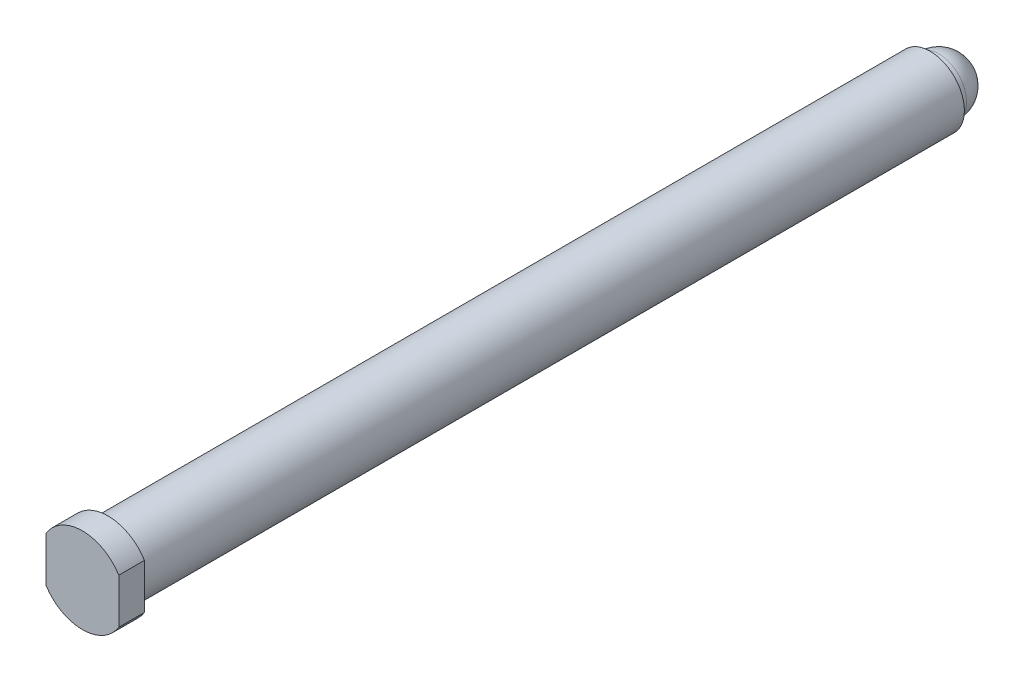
ISO-10303-21;
HEADER;
FILE_DESCRIPTION(('STEP AP214'),'2;1');
FILE_NAME('part.step','',(''),(''),'','','');
FILE_SCHEMA(('AUTOMOTIVE_DESIGN { 1 0 10303 214 1 1 1 1 }'));
ENDSEC;
DATA;
#1=APPLICATION_CONTEXT('core data for automotive mechanical design processes');
#2=APPLICATION_PROTOCOL_DEFINITION('international standard','automotive_design',2000,#1);
#3=PRODUCT_CONTEXT('',#1,'mechanical');
#4=PRODUCT('Part','Part','',(#3));
#5=PRODUCT_RELATED_PRODUCT_CATEGORY('part','',(#4));
#6=PRODUCT_DEFINITION_FORMATION('','',#4);
#7=PRODUCT_DEFINITION_CONTEXT('part definition',#1,'design');
#8=PRODUCT_DEFINITION('design','',#6,#7);
#9=PRODUCT_DEFINITION_SHAPE('','',#8);
#10=(LENGTH_UNIT() NAMED_UNIT(*) SI_UNIT(.MILLI.,.METRE.));
#11=(NAMED_UNIT(*) PLANE_ANGLE_UNIT() SI_UNIT($,.RADIAN.));
#12=(NAMED_UNIT(*) SI_UNIT($,.STERADIAN.) SOLID_ANGLE_UNIT());
#13=UNCERTAINTY_MEASURE_WITH_UNIT(LENGTH_MEASURE(1.E-05),#10,'distance_accuracy_value','');
#14=(GEOMETRIC_REPRESENTATION_CONTEXT(3) GLOBAL_UNCERTAINTY_ASSIGNED_CONTEXT((#13)) GLOBAL_UNIT_ASSIGNED_CONTEXT((#10,
#11,#12)) REPRESENTATION_CONTEXT('',''));
#15=CARTESIAN_POINT('',(0.,0.,0.));
#16=DIRECTION('',(0.,0.,1.));
#17=DIRECTION('',(1.,0.,0.));
#18=AXIS2_PLACEMENT_3D('',#15,#16,#17);
#19=CARTESIAN_POINT('',(0.,10.,-6.));
#20=DIRECTION('',(0.,0.,1.));
#21=DIRECTION('',(1.,0.,0.));
#22=AXIS2_PLACEMENT_3D('',#19,#20,#21);
#23=PLANE('',#22);
#24=CARTESIAN_POINT('',(0.,0.,-6.));
#25=DIRECTION('',(0.,0.,1.));
#26=DIRECTION('',(1.,0.,0.));
#27=AXIS2_PLACEMENT_3D('',#24,#25,#26);
#28=CIRCLE('',#27,8.);
#29=CARTESIAN_POINT('',(8.,0.,-6.));
#30=VERTEX_POINT('',#29);
#31=EDGE_CURVE('E98',#30,#30,#28,.T.);
#32=ORIENTED_EDGE('',*,*,#31,.T.);
#33=EDGE_LOOP('',(#32));
#34=FACE_BOUND('',#33,.T.);
#35=DIRECTION('',(0.,-1.,0.));
#36=VECTOR('',#35,1.);
#37=CARTESIAN_POINT('',(-8.5,10.3009259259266,-6.));
#38=LINE('',#37,#36);
#39=CARTESIAN_POINT('',(-8.5,5.26782687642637,-6.));
#40=VERTEX_POINT('',#39);
#41=CARTESIAN_POINT('',(-8.5,-5.26782687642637,-6.));
#42=VERTEX_POINT('',#41);
#43=EDGE_CURVE('E183',#40,#42,#38,.T.);
#44=ORIENTED_EDGE('',*,*,#43,.F.);
#45=CARTESIAN_POINT('',(0.,0.,-6.));
#46=DIRECTION('',(0.,0.,1.));
#47=DIRECTION('',(1.,0.,0.));
#48=AXIS2_PLACEMENT_3D('',#45,#46,#47);
#49=CIRCLE('',#48,10.);
#50=CARTESIAN_POINT('',(8.5,5.26782687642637,-6.));
#51=VERTEX_POINT('',#50);
#52=EDGE_CURVE('E95',#51,#40,#49,.T.);
#53=ORIENTED_EDGE('',*,*,#52,.F.);
#54=DIRECTION('',(0.,1.,0.));
#55=VECTOR('',#54,1.);
#56=CARTESIAN_POINT('',(8.5,10.3009259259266,-6.));
#57=LINE('',#56,#55);
#58=CARTESIAN_POINT('',(8.5,-5.26782687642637,-6.));
#59=VERTEX_POINT('',#58);
#60=EDGE_CURVE('E85',#59,#51,#57,.T.);
#61=ORIENTED_EDGE('',*,*,#60,.F.);
#62=EDGE_CURVE('E84',#42,#59,#49,.T.);
#63=ORIENTED_EDGE('',*,*,#62,.F.);
#64=EDGE_LOOP('',(#44,#53,#61,#63));
#65=FACE_BOUND('',#64,.T.);
#66=ADVANCED_FACE('F29',(#34,#65),#23,.F.);
#67=CARTESIAN_POINT('',(0.,0.,0.));
#68=DIRECTION('',(0.,0.,1.));
#69=DIRECTION('',(1.,0.,0.));
#70=AXIS2_PLACEMENT_3D('',#67,#68,#69);
#71=CYLINDRICAL_SURFACE('',#70,10.);
#72=DIRECTION('',(0.,0.,1.));
#73=VECTOR('',#72,1.);
#74=CARTESIAN_POINT('',(-8.5,-5.26782687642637,0.));
#75=LINE('',#74,#73);
#76=CARTESIAN_POINT('',(-8.5,-5.26782687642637,0.));
#77=VERTEX_POINT('',#76);
#78=EDGE_CURVE('E43',#42,#77,#75,.T.);
#79=ORIENTED_EDGE('',*,*,#78,.F.);
#80=ORIENTED_EDGE('',*,*,#62,.T.);
#81=DIRECTION('',(0.,0.,1.));
#82=VECTOR('',#81,1.);
#83=CARTESIAN_POINT('',(8.5,-5.26782687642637,0.));
#84=LINE('',#83,#82);
#85=CARTESIAN_POINT('',(8.5,-5.26782687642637,0.));
#86=VERTEX_POINT('',#85);
#87=EDGE_CURVE('E71',#86,#59,#84,.F.);
#88=ORIENTED_EDGE('',*,*,#87,.F.);
#89=CARTESIAN_POINT('',(0.,0.,0.));
#90=DIRECTION('',(0.,0.,1.));
#91=DIRECTION('',(1.,0.,0.));
#92=AXIS2_PLACEMENT_3D('',#89,#90,#91);
#93=CIRCLE('',#92,10.);
#94=EDGE_CURVE('E82',#77,#86,#93,.T.);
#95=ORIENTED_EDGE('',*,*,#94,.F.);
#96=EDGE_LOOP('',(#79,#80,#88,#95));
#97=FACE_BOUND('',#96,.T.);
#98=ADVANCED_FACE('F81',(#97),#71,.T.);
#99=DIRECTION('',(0.,0.,1.));
#100=VECTOR('',#99,1.);
#101=CARTESIAN_POINT('',(-8.5,5.26782687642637,0.));
#102=LINE('',#101,#100);
#103=CARTESIAN_POINT('',(-8.5,5.26782687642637,0.));
#104=VERTEX_POINT('',#103);
#105=EDGE_CURVE('E176',#104,#40,#102,.F.);
#106=ORIENTED_EDGE('',*,*,#105,.F.);
#107=CARTESIAN_POINT('',(8.5,5.26782687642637,0.));
#108=VERTEX_POINT('',#107);
#109=EDGE_CURVE('E88',#108,#104,#93,.T.);
#110=ORIENTED_EDGE('',*,*,#109,.F.);
#111=DIRECTION('',(0.,0.,1.));
#112=VECTOR('',#111,1.);
#113=CARTESIAN_POINT('',(8.5,5.26782687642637,0.));
#114=LINE('',#113,#112);
#115=EDGE_CURVE('E51',#51,#108,#114,.T.);
#116=ORIENTED_EDGE('',*,*,#115,.F.);
#117=ORIENTED_EDGE('',*,*,#52,.T.);
#118=EDGE_LOOP('',(#106,#110,#116,#117));
#119=FACE_BOUND('',#118,.T.);
#120=ADVANCED_FACE('F147',(#119),#71,.T.);
#121=CARTESIAN_POINT('',(0.,0.,0.));
#122=DIRECTION('',(0.,0.,-1.));
#123=DIRECTION('',(-1.,0.,0.));
#124=AXIS2_PLACEMENT_3D('',#121,#122,#123);
#125=PLANE('',#124);
#126=DIRECTION('',(0.,1.,0.));
#127=VECTOR('',#126,1.);
#128=CARTESIAN_POINT('',(-8.5,0.,0.));
#129=LINE('',#128,#127);
#130=EDGE_CURVE('E12',#77,#104,#129,.T.);
#131=ORIENTED_EDGE('',*,*,#130,.F.);
#132=ORIENTED_EDGE('',*,*,#94,.T.);
#133=DIRECTION('',(0.,-1.,0.));
#134=VECTOR('',#133,1.);
#135=CARTESIAN_POINT('',(8.5,0.,0.));
#136=LINE('',#135,#134);
#137=EDGE_CURVE('E37',#108,#86,#136,.T.);
#138=ORIENTED_EDGE('',*,*,#137,.F.);
#139=ORIENTED_EDGE('',*,*,#109,.T.);
#140=EDGE_LOOP('',(#131,#132,#138,#139));
#141=FACE_BOUND('',#140,.T.);
#142=ADVANCED_FACE('F87',(#141),#125,.F.);
#143=CARTESIAN_POINT('',(0.,0.,-200.));
#144=DIRECTION('',(0.,0.,1.));
#145=DIRECTION('',(0.,1.,0.));
#146=AXIS2_PLACEMENT_3D('',#143,#144,#145);
#147=SPHERICAL_SURFACE('',#146,6.5);
#148=CARTESIAN_POINT('',(0.,0.,-205.672951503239));
#149=DIRECTION('',(0.,0.,1.));
#150=DIRECTION('',(0.,-1.,0.));
#151=AXIS2_PLACEMENT_3D('',#148,#149,#150);
#152=CIRCLE('',#151,3.17295150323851);
#153=CARTESIAN_POINT('',(0.,-3.17295150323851,-205.672951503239));
#154=VERTEX_POINT('',#153);
#155=EDGE_CURVE('E110',#154,#154,#152,.T.);
#156=ORIENTED_EDGE('',*,*,#155,.T.);
#157=EDGE_LOOP('',(#156));
#158=FACE_BOUND('',#157,.T.);
#159=CARTESIAN_POINT('',(0.,0.,-200.));
#160=DIRECTION('',(0.,0.,1.));
#161=DIRECTION('',(1.,0.,0.));
#162=AXIS2_PLACEMENT_3D('',#159,#160,#161);
#163=CIRCLE('',#162,6.5);
#164=CARTESIAN_POINT('',(6.5,0.,-200.));
#165=VERTEX_POINT('',#164);
#166=EDGE_CURVE('E107',#165,#165,#163,.T.);
#167=ORIENTED_EDGE('',*,*,#166,.F.);
#168=EDGE_LOOP('',(#167));
#169=FACE_BOUND('',#168,.T.);
#170=ADVANCED_FACE('F31',(#158,#169),#147,.T.);
#171=CARTESIAN_POINT('',(0.,0.,0.));
#172=DIRECTION('',(0.,0.,1.));
#173=DIRECTION('',(1.,0.,0.));
#174=AXIS2_PLACEMENT_3D('',#171,#172,#173);
#175=CYLINDRICAL_SURFACE('',#174,6.5);
#176=CARTESIAN_POINT('',(0.,0.,-198.));
#177=DIRECTION('',(0.,0.,1.));
#178=DIRECTION('',(1.,0.,0.));
#179=AXIS2_PLACEMENT_3D('',#176,#177,#178);
#180=CIRCLE('',#179,6.5);
#181=CARTESIAN_POINT('',(6.5,0.,-198.));
#182=VERTEX_POINT('',#181);
#183=EDGE_CURVE('E104',#182,#182,#180,.T.);
#184=ORIENTED_EDGE('',*,*,#183,.F.);
#185=EDGE_LOOP('',(#184));
#186=FACE_BOUND('',#185,.T.);
#187=ORIENTED_EDGE('',*,*,#166,.T.);
#188=EDGE_LOOP('',(#187));
#189=FACE_BOUND('',#188,.T.);
#190=ADVANCED_FACE('F128',(#186,#189),#175,.T.);
#191=CARTESIAN_POINT('',(0.,8.,-198.));
#192=DIRECTION('',(0.,0.,1.));
#193=DIRECTION('',(1.,0.,0.));
#194=AXIS2_PLACEMENT_3D('',#191,#192,#193);
#195=PLANE('',#194);
#196=CARTESIAN_POINT('',(0.,0.,-198.));
#197=DIRECTION('',(0.,0.,1.));
#198=DIRECTION('',(1.,0.,0.));
#199=AXIS2_PLACEMENT_3D('',#196,#197,#198);
#200=CIRCLE('',#199,8.);
#201=CARTESIAN_POINT('',(8.,0.,-198.));
#202=VERTEX_POINT('',#201);
#203=EDGE_CURVE('E101',#202,#202,#200,.T.);
#204=ORIENTED_EDGE('',*,*,#203,.F.);
#205=EDGE_LOOP('',(#204));
#206=FACE_BOUND('',#205,.T.);
#207=ORIENTED_EDGE('',*,*,#183,.T.);
#208=EDGE_LOOP('',(#207));
#209=FACE_BOUND('',#208,.T.);
#210=ADVANCED_FACE('F132',(#206,#209),#195,.F.);
#211=CARTESIAN_POINT('',(0.,0.,0.));
#212=DIRECTION('',(0.,0.,1.));
#213=DIRECTION('',(1.,0.,0.));
#214=AXIS2_PLACEMENT_3D('',#211,#212,#213);
#215=CYLINDRICAL_SURFACE('',#214,8.);
#216=ORIENTED_EDGE('',*,*,#31,.F.);
#217=EDGE_LOOP('',(#216));
#218=FACE_BOUND('',#217,.T.);
#219=ORIENTED_EDGE('',*,*,#203,.T.);
#220=EDGE_LOOP('',(#219));
#221=FACE_BOUND('',#220,.T.);
#222=ADVANCED_FACE('F137',(#218,#221),#215,.T.);
#223=CARTESIAN_POINT('',(0.,0.,-206.5));
#224=DIRECTION('',(0.,0.,-1.));
#225=DIRECTION('',(0.,1.,0.));
#226=AXIS2_PLACEMENT_3D('',#223,#224,#225);
#227=CYLINDRICAL_SURFACE('',#226,2.5);
#228=CARTESIAN_POINT('',(0.,0.,-205.));
#229=DIRECTION('',(0.,0.,1.));
#230=DIRECTION('',(0.,-1.,0.));
#231=AXIS2_PLACEMENT_3D('',#228,#229,#230);
#232=CIRCLE('',#231,2.5);
#233=CARTESIAN_POINT('',(0.,-2.5,-205.));
#234=VERTEX_POINT('',#233);
#235=EDGE_CURVE('E77',#234,#234,#232,.F.);
#236=ORIENTED_EDGE('',*,*,#235,.T.);
#237=EDGE_LOOP('',(#236));
#238=FACE_BOUND('',#237,.T.);
#239=CARTESIAN_POINT('',(0.,0.,-189.5));
#240=DIRECTION('',(0.,0.,-1.));
#241=DIRECTION('',(0.,1.,0.));
#242=AXIS2_PLACEMENT_3D('',#239,#240,#241);
#243=CIRCLE('',#242,2.49999999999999);
#244=CARTESIAN_POINT('',(0.,2.49999999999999,-189.5));
#245=VERTEX_POINT('',#244);
#246=EDGE_CURVE('E89',#245,#245,#243,.T.);
#247=ORIENTED_EDGE('',*,*,#246,.F.);
#248=EDGE_LOOP('',(#247));
#249=FACE_BOUND('',#248,.T.);
#250=ADVANCED_FACE('F116',(#238,#249),#227,.F.);
#251=CARTESIAN_POINT('',(0.,0.,-189.5));
#252=DIRECTION('',(0.,0.,-1.));
#253=DIRECTION('',(0.,1.,0.));
#254=AXIS2_PLACEMENT_3D('',#251,#252,#253);
#255=CONICAL_SURFACE('',#254,2.49999999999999,1.0471975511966);
#256=CARTESIAN_POINT('',(0.,0.,-188.056624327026));
#257=VERTEX_POINT('',#256);
#258=VERTEX_LOOP('',#257);
#259=FACE_BOUND('',#258,.T.);
#260=ORIENTED_EDGE('',*,*,#246,.T.);
#261=EDGE_LOOP('',(#260));
#262=FACE_BOUND('',#261,.T.);
#263=ADVANCED_FACE('F122',(#259,#262),#255,.F.);
#264=CARTESIAN_POINT('',(0.,0.,-205.672951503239));
#265=DIRECTION('',(0.,0.,-1.));
#266=DIRECTION('',(0.,1.,0.));
#267=AXIS2_PLACEMENT_3D('',#264,#265,#266);
#268=CONICAL_SURFACE('',#267,3.1729515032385,0.78539816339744);
#269=ORIENTED_EDGE('',*,*,#235,.F.);
#270=EDGE_LOOP('',(#269));
#271=FACE_BOUND('',#270,.T.);
#272=ORIENTED_EDGE('',*,*,#155,.F.);
#273=EDGE_LOOP('',(#272));
#274=FACE_BOUND('',#273,.T.);
#275=ADVANCED_FACE('F119',(#271,#274),#268,.F.);
#276=CARTESIAN_POINT('',(8.5,10.3009259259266,-6.));
#277=DIRECTION('',(1.,0.,0.));
#278=DIRECTION('',(0.,0.,-1.));
#279=AXIS2_PLACEMENT_3D('',#276,#277,#278);
#280=PLANE('',#279);
#281=ORIENTED_EDGE('',*,*,#115,.T.);
#282=ORIENTED_EDGE('',*,*,#137,.T.);
#283=ORIENTED_EDGE('',*,*,#87,.T.);
#284=ORIENTED_EDGE('',*,*,#60,.T.);
#285=EDGE_LOOP('',(#281,#282,#283,#284));
#286=FACE_BOUND('',#285,.T.);
#287=ADVANCED_FACE('F70',(#286),#280,.T.);
#288=CARTESIAN_POINT('',(-8.5,10.3009259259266,-6.));
#289=DIRECTION('',(-1.,0.,0.));
#290=DIRECTION('',(0.,-1.,0.));
#291=AXIS2_PLACEMENT_3D('',#288,#289,#290);
#292=PLANE('',#291);
#293=ORIENTED_EDGE('',*,*,#78,.T.);
#294=ORIENTED_EDGE('',*,*,#130,.T.);
#295=ORIENTED_EDGE('',*,*,#105,.T.);
#296=ORIENTED_EDGE('',*,*,#43,.T.);
#297=EDGE_LOOP('',(#293,#294,#295,#296));
#298=FACE_BOUND('',#297,.T.);
#299=ADVANCED_FACE('F184',(#298),#292,.T.);
#300=CLOSED_SHELL('',(#66,#98,#120,#142,#170,#190,#210,#222,#250,#263,#275,#287,#299));
#301=MANIFOLD_SOLID_BREP('B2',#300);
#302=ADVANCED_BREP_SHAPE_REPRESENTATION('',(#18,#301),#14);
#303=SHAPE_DEFINITION_REPRESENTATION(#9,#302);
ENDSEC;
END-ISO-10303-21;
